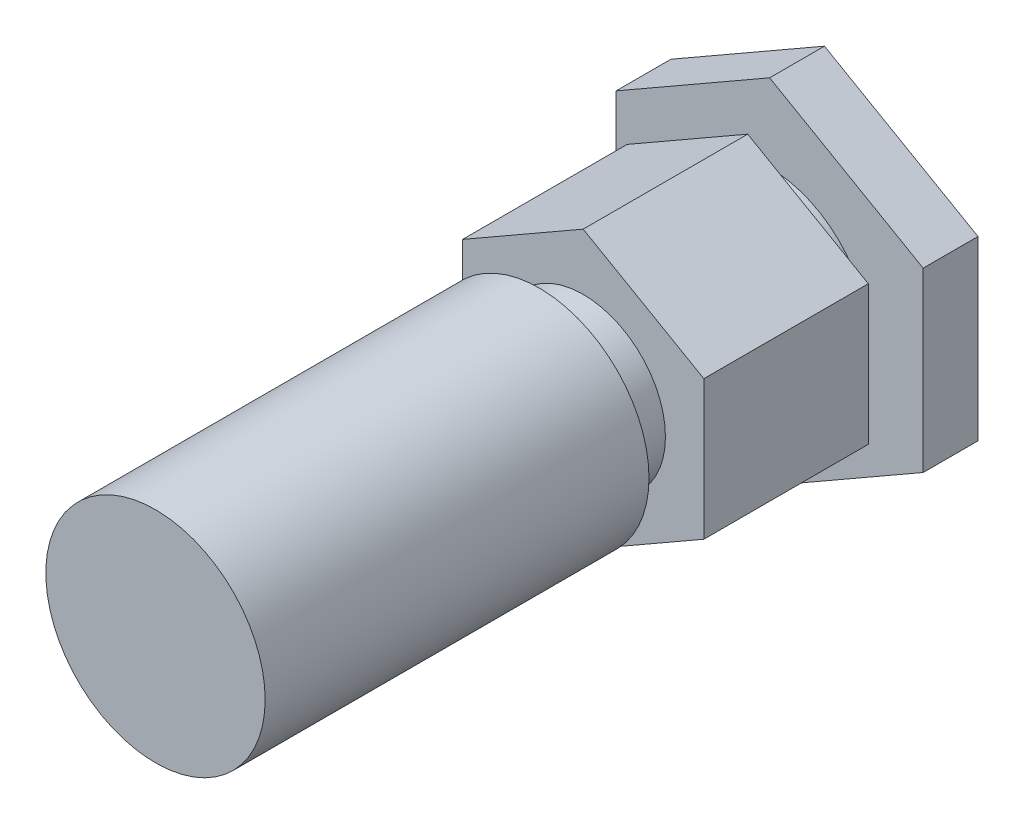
ISO-10303-21;
HEADER;
FILE_DESCRIPTION(('STEP AP214'),'2;1');
FILE_NAME('part.step','',(''),(''),'','','');
FILE_SCHEMA(('AUTOMOTIVE_DESIGN { 1 0 10303 214 1 1 1 1 }'));
ENDSEC;
DATA;
#1=APPLICATION_CONTEXT('core data for automotive mechanical design processes');
#2=APPLICATION_PROTOCOL_DEFINITION('international standard','automotive_design',2000,#1);
#3=PRODUCT_CONTEXT('',#1,'mechanical');
#4=PRODUCT('Part','Part','',(#3));
#5=PRODUCT_RELATED_PRODUCT_CATEGORY('part','',(#4));
#6=PRODUCT_DEFINITION_FORMATION('','',#4);
#7=PRODUCT_DEFINITION_CONTEXT('part definition',#1,'design');
#8=PRODUCT_DEFINITION('design','',#6,#7);
#9=PRODUCT_DEFINITION_SHAPE('','',#8);
#10=(LENGTH_UNIT() NAMED_UNIT(*) SI_UNIT(.MILLI.,.METRE.));
#11=(NAMED_UNIT(*) PLANE_ANGLE_UNIT() SI_UNIT($,.RADIAN.));
#12=(NAMED_UNIT(*) SI_UNIT($,.STERADIAN.) SOLID_ANGLE_UNIT());
#13=UNCERTAINTY_MEASURE_WITH_UNIT(LENGTH_MEASURE(1.E-05),#10,'distance_accuracy_value','');
#14=(GEOMETRIC_REPRESENTATION_CONTEXT(3) GLOBAL_UNCERTAINTY_ASSIGNED_CONTEXT((#13)) GLOBAL_UNIT_ASSIGNED_CONTEXT((#10,
#11,#12)) REPRESENTATION_CONTEXT('',''));
#15=CARTESIAN_POINT('',(0.,0.,0.));
#16=DIRECTION('',(0.,0.,1.));
#17=DIRECTION('',(1.,0.,0.));
#18=AXIS2_PLACEMENT_3D('',#15,#16,#17);
#19=CARTESIAN_POINT('',(-11.,6.34053203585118,22.));
#20=DIRECTION('',(0.,0.,1.));
#21=DIRECTION('',(1.,0.,0.));
#22=AXIS2_PLACEMENT_3D('',#19,#20,#21);
#23=PLANE('',#22);
#24=DIRECTION('',(-0.867435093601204,-0.497550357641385,0.));
#25=VECTOR('',#24,1.);
#26=CARTESIAN_POINT('',(0.,12.65,22.));
#27=LINE('',#26,#25);
#28=CARTESIAN_POINT('',(0.,12.65,22.));
#29=VERTEX_POINT('',#28);
#30=CARTESIAN_POINT('',(-11.,6.34053203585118,22.));
#31=VERTEX_POINT('',#30);
#32=EDGE_CURVE('E168',#29,#31,#27,.T.);
#33=ORIENTED_EDGE('',*,*,#32,.T.);
#34=DIRECTION('',(0.,-1.,0.));
#35=VECTOR('',#34,1.);
#36=CARTESIAN_POINT('',(-11.,6.34053203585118,22.));
#37=LINE('',#36,#35);
#38=CARTESIAN_POINT('',(-11.,-6.34053203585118,22.));
#39=VERTEX_POINT('',#38);
#40=EDGE_CURVE('E143',#31,#39,#37,.T.);
#41=ORIENTED_EDGE('',*,*,#40,.T.);
#42=DIRECTION('',(0.867435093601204,-0.497550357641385,0.));
#43=VECTOR('',#42,1.);
#44=CARTESIAN_POINT('',(0.,-12.65,22.));
#45=LINE('',#44,#43);
#46=CARTESIAN_POINT('',(0.,-12.65,22.));
#47=VERTEX_POINT('',#46);
#48=EDGE_CURVE('E171',#39,#47,#45,.T.);
#49=ORIENTED_EDGE('',*,*,#48,.T.);
#50=DIRECTION('',(0.867435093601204,0.497550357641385,0.));
#51=VECTOR('',#50,1.);
#52=CARTESIAN_POINT('',(0.,-12.65,22.));
#53=LINE('',#52,#51);
#54=CARTESIAN_POINT('',(11.,-6.34053203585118,22.));
#55=VERTEX_POINT('',#54);
#56=EDGE_CURVE('E173',#47,#55,#53,.T.);
#57=ORIENTED_EDGE('',*,*,#56,.T.);
#58=DIRECTION('',(0.,1.,0.));
#59=VECTOR('',#58,1.);
#60=CARTESIAN_POINT('',(11.,6.34053203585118,22.));
#61=LINE('',#60,#59);
#62=CARTESIAN_POINT('',(11.,6.34053203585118,22.));
#63=VERTEX_POINT('',#62);
#64=EDGE_CURVE('E175',#55,#63,#61,.T.);
#65=ORIENTED_EDGE('',*,*,#64,.T.);
#66=DIRECTION('',(-0.867435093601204,0.497550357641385,0.));
#67=VECTOR('',#66,1.);
#68=CARTESIAN_POINT('',(0.,12.65,22.));
#69=LINE('',#68,#67);
#70=EDGE_CURVE('E177',#63,#29,#69,.T.);
#71=ORIENTED_EDGE('',*,*,#70,.T.);
#72=EDGE_LOOP('',(#33,#41,#49,#57,#65,#71));
#73=FACE_BOUND('',#72,.T.);
#74=CARTESIAN_POINT('',(0.,0.,22.));
#75=DIRECTION('',(0.,0.,1.));
#76=DIRECTION('',(1.,0.,0.));
#77=AXIS2_PLACEMENT_3D('',#74,#75,#76);
#78=CIRCLE('',#77,7.5);
#79=CARTESIAN_POINT('',(7.5,0.,22.));
#80=VERTEX_POINT('',#79);
#81=EDGE_CURVE('E157',#80,#80,#78,.T.);
#82=ORIENTED_EDGE('',*,*,#81,.F.);
#83=EDGE_LOOP('',(#82));
#84=FACE_BOUND('',#83,.T.);
#85=ADVANCED_FACE('F37',(#73,#84),#23,.T.);
#86=CARTESIAN_POINT('',(-14.,8.06976804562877,5.));
#87=DIRECTION('',(0.,0.,1.));
#88=DIRECTION('',(1.,0.,0.));
#89=AXIS2_PLACEMENT_3D('',#86,#87,#88);
#90=PLANE('',#89);
#91=DIRECTION('',(-0.867435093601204,-0.497550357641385,0.));
#92=VECTOR('',#91,1.);
#93=CARTESIAN_POINT('',(0.,16.1,5.));
#94=LINE('',#93,#92);
#95=CARTESIAN_POINT('',(0.,16.1,5.));
#96=VERTEX_POINT('',#95);
#97=CARTESIAN_POINT('',(-14.,8.06976804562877,5.));
#98=VERTEX_POINT('',#97);
#99=EDGE_CURVE('E211',#96,#98,#94,.T.);
#100=ORIENTED_EDGE('',*,*,#99,.T.);
#101=DIRECTION('',(0.,-1.,0.));
#102=VECTOR('',#101,1.);
#103=CARTESIAN_POINT('',(-14.,8.06976804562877,5.));
#104=LINE('',#103,#102);
#105=CARTESIAN_POINT('',(-14.,-8.06976804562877,5.));
#106=VERTEX_POINT('',#105);
#107=EDGE_CURVE('E213',#98,#106,#104,.T.);
#108=ORIENTED_EDGE('',*,*,#107,.T.);
#109=DIRECTION('',(0.867435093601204,-0.497550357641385,0.));
#110=VECTOR('',#109,1.);
#111=CARTESIAN_POINT('',(0.,-16.1,5.));
#112=LINE('',#111,#110);
#113=CARTESIAN_POINT('',(0.,-16.1,5.));
#114=VERTEX_POINT('',#113);
#115=EDGE_CURVE('E215',#106,#114,#112,.T.);
#116=ORIENTED_EDGE('',*,*,#115,.T.);
#117=DIRECTION('',(0.867435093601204,0.497550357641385,0.));
#118=VECTOR('',#117,1.);
#119=CARTESIAN_POINT('',(0.,-16.1,5.));
#120=LINE('',#119,#118);
#121=CARTESIAN_POINT('',(14.,-8.06976804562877,5.));
#122=VERTEX_POINT('',#121);
#123=EDGE_CURVE('E217',#114,#122,#120,.T.);
#124=ORIENTED_EDGE('',*,*,#123,.T.);
#125=DIRECTION('',(0.,1.,0.));
#126=VECTOR('',#125,1.);
#127=CARTESIAN_POINT('',(14.,8.06976804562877,5.));
#128=LINE('',#127,#126);
#129=CARTESIAN_POINT('',(14.,8.06976804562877,5.));
#130=VERTEX_POINT('',#129);
#131=EDGE_CURVE('E58',#122,#130,#128,.T.);
#132=ORIENTED_EDGE('',*,*,#131,.T.);
#133=DIRECTION('',(-0.867435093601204,0.497550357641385,0.));
#134=VECTOR('',#133,1.);
#135=CARTESIAN_POINT('',(0.,16.1,5.));
#136=LINE('',#135,#134);
#137=EDGE_CURVE('E53',#130,#96,#136,.T.);
#138=ORIENTED_EDGE('',*,*,#137,.T.);
#139=EDGE_LOOP('',(#100,#108,#116,#124,#132,#138));
#140=FACE_BOUND('',#139,.T.);
#141=CARTESIAN_POINT('',(0.,0.,5.));
#142=DIRECTION('',(0.,0.,1.));
#143=DIRECTION('',(1.,0.,0.));
#144=AXIS2_PLACEMENT_3D('',#141,#142,#143);
#145=CIRCLE('',#144,9.);
#146=CARTESIAN_POINT('',(9.,0.,5.));
#147=VERTEX_POINT('',#146);
#148=EDGE_CURVE('E195',#147,#147,#145,.F.);
#149=ORIENTED_EDGE('',*,*,#148,.T.);
#150=EDGE_LOOP('',(#149));
#151=FACE_BOUND('',#150,.T.);
#152=ADVANCED_FACE('F245',(#140,#151),#90,.T.);
#153=CARTESIAN_POINT('',(-14.,8.06976804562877,0.));
#154=DIRECTION('',(0.,0.,1.));
#155=DIRECTION('',(1.,0.,0.));
#156=AXIS2_PLACEMENT_3D('',#153,#154,#155);
#157=PLANE('',#156);
#158=DIRECTION('',(-0.867435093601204,-0.497550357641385,0.));
#159=VECTOR('',#158,1.);
#160=CARTESIAN_POINT('',(0.,16.1,0.));
#161=LINE('',#160,#159);
#162=CARTESIAN_POINT('',(0.,16.1,0.));
#163=VERTEX_POINT('',#162);
#164=CARTESIAN_POINT('',(-14.,8.06976804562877,0.));
#165=VERTEX_POINT('',#164);
#166=EDGE_CURVE('E198',#163,#165,#161,.T.);
#167=ORIENTED_EDGE('',*,*,#166,.F.);
#168=DIRECTION('',(-0.867435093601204,0.497550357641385,0.));
#169=VECTOR('',#168,1.);
#170=CARTESIAN_POINT('',(0.,16.1,0.));
#171=LINE('',#170,#169);
#172=CARTESIAN_POINT('',(14.,8.06976804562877,0.));
#173=VERTEX_POINT('',#172);
#174=EDGE_CURVE('E209',#173,#163,#171,.T.);
#175=ORIENTED_EDGE('',*,*,#174,.F.);
#176=DIRECTION('',(0.,1.,0.));
#177=VECTOR('',#176,1.);
#178=CARTESIAN_POINT('',(14.,8.06976804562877,0.));
#179=LINE('',#178,#177);
#180=CARTESIAN_POINT('',(14.,-8.06976804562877,0.));
#181=VERTEX_POINT('',#180);
#182=EDGE_CURVE('E207',#181,#173,#179,.T.);
#183=ORIENTED_EDGE('',*,*,#182,.F.);
#184=DIRECTION('',(0.867435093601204,0.497550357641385,0.));
#185=VECTOR('',#184,1.);
#186=CARTESIAN_POINT('',(0.,-16.1,0.));
#187=LINE('',#186,#185);
#188=CARTESIAN_POINT('',(0.,-16.1,0.));
#189=VERTEX_POINT('',#188);
#190=EDGE_CURVE('E205',#189,#181,#187,.T.);
#191=ORIENTED_EDGE('',*,*,#190,.F.);
#192=DIRECTION('',(0.867435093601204,-0.497550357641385,0.));
#193=VECTOR('',#192,1.);
#194=CARTESIAN_POINT('',(0.,-16.1,0.));
#195=LINE('',#194,#193);
#196=CARTESIAN_POINT('',(-14.,-8.06976804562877,0.));
#197=VERTEX_POINT('',#196);
#198=EDGE_CURVE('E203',#197,#189,#195,.T.);
#199=ORIENTED_EDGE('',*,*,#198,.F.);
#200=DIRECTION('',(0.,-1.,0.));
#201=VECTOR('',#200,1.);
#202=CARTESIAN_POINT('',(-14.,8.06976804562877,0.));
#203=LINE('',#202,#201);
#204=EDGE_CURVE('E201',#165,#197,#203,.T.);
#205=ORIENTED_EDGE('',*,*,#204,.F.);
#206=EDGE_LOOP('',(#167,#175,#183,#191,#199,#205));
#207=FACE_BOUND('',#206,.T.);
#208=CARTESIAN_POINT('',(0.,0.,0.));
#209=DIRECTION('',(0.,0.,1.));
#210=DIRECTION('',(1.,0.,0.));
#211=AXIS2_PLACEMENT_3D('',#208,#209,#210);
#212=CIRCLE('',#211,9.);
#213=CARTESIAN_POINT('',(9.,0.,0.));
#214=VERTEX_POINT('',#213);
#215=EDGE_CURVE('E46',#214,#214,#212,.F.);
#216=ORIENTED_EDGE('',*,*,#215,.F.);
#217=EDGE_LOOP('',(#216));
#218=FACE_BOUND('',#217,.T.);
#219=ADVANCED_FACE('F243',(#207,#218),#157,.F.);
#220=CARTESIAN_POINT('',(0.,16.1,5.));
#221=DIRECTION('',(0.497550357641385,-0.867435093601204,0.));
#222=DIRECTION('',(0.867435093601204,0.497550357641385,0.));
#223=AXIS2_PLACEMENT_3D('',#220,#221,#222);
#224=PLANE('',#223);
#225=ORIENTED_EDGE('',*,*,#166,.T.);
#226=DIRECTION('',(0.,0.,-1.));
#227=VECTOR('',#226,1.);
#228=CARTESIAN_POINT('',(-14.,8.06976804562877,5.));
#229=LINE('',#228,#227);
#230=EDGE_CURVE('E236',#98,#165,#229,.T.);
#231=ORIENTED_EDGE('',*,*,#230,.F.);
#232=ORIENTED_EDGE('',*,*,#99,.F.);
#233=DIRECTION('',(0.,0.,-1.));
#234=VECTOR('',#233,1.);
#235=CARTESIAN_POINT('',(0.,16.1,5.));
#236=LINE('',#235,#234);
#237=EDGE_CURVE('E221',#96,#163,#236,.T.);
#238=ORIENTED_EDGE('',*,*,#237,.T.);
#239=EDGE_LOOP('',(#225,#231,#232,#238));
#240=FACE_BOUND('',#239,.T.);
#241=ADVANCED_FACE('F39',(#240),#224,.F.);
#242=CARTESIAN_POINT('',(-14.,8.06976804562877,5.));
#243=DIRECTION('',(1.,0.,0.));
#244=DIRECTION('',(0.,0.,-1.));
#245=AXIS2_PLACEMENT_3D('',#242,#243,#244);
#246=PLANE('',#245);
#247=ORIENTED_EDGE('',*,*,#204,.T.);
#248=DIRECTION('',(0.,0.,-1.));
#249=VECTOR('',#248,1.);
#250=CARTESIAN_POINT('',(-14.,-8.06976804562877,5.));
#251=LINE('',#250,#249);
#252=EDGE_CURVE('E233',#106,#197,#251,.T.);
#253=ORIENTED_EDGE('',*,*,#252,.F.);
#254=ORIENTED_EDGE('',*,*,#107,.F.);
#255=ORIENTED_EDGE('',*,*,#230,.T.);
#256=EDGE_LOOP('',(#247,#253,#254,#255));
#257=FACE_BOUND('',#256,.T.);
#258=ADVANCED_FACE('F252',(#257),#246,.F.);
#259=CARTESIAN_POINT('',(0.,-16.1,5.));
#260=DIRECTION('',(0.497550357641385,0.867435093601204,0.));
#261=DIRECTION('',(-0.867435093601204,0.497550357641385,0.));
#262=AXIS2_PLACEMENT_3D('',#259,#260,#261);
#263=PLANE('',#262);
#264=ORIENTED_EDGE('',*,*,#198,.T.);
#265=DIRECTION('',(0.,0.,-1.));
#266=VECTOR('',#265,1.);
#267=CARTESIAN_POINT('',(0.,-16.1,5.));
#268=LINE('',#267,#266);
#269=EDGE_CURVE('E230',#114,#189,#268,.T.);
#270=ORIENTED_EDGE('',*,*,#269,.F.);
#271=ORIENTED_EDGE('',*,*,#115,.F.);
#272=ORIENTED_EDGE('',*,*,#252,.T.);
#273=EDGE_LOOP('',(#264,#270,#271,#272));
#274=FACE_BOUND('',#273,.T.);
#275=ADVANCED_FACE('F468',(#274),#263,.F.);
#276=CARTESIAN_POINT('',(0.,-16.1,5.));
#277=DIRECTION('',(-0.497550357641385,0.867435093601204,0.));
#278=DIRECTION('',(-0.867435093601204,-0.497550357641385,0.));
#279=AXIS2_PLACEMENT_3D('',#276,#277,#278);
#280=PLANE('',#279);
#281=ORIENTED_EDGE('',*,*,#190,.T.);
#282=DIRECTION('',(0.,0.,-1.));
#283=VECTOR('',#282,1.);
#284=CARTESIAN_POINT('',(14.,-8.06976804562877,5.));
#285=LINE('',#284,#283);
#286=EDGE_CURVE('E227',#122,#181,#285,.T.);
#287=ORIENTED_EDGE('',*,*,#286,.F.);
#288=ORIENTED_EDGE('',*,*,#123,.F.);
#289=ORIENTED_EDGE('',*,*,#269,.T.);
#290=EDGE_LOOP('',(#281,#287,#288,#289));
#291=FACE_BOUND('',#290,.T.);
#292=ADVANCED_FACE('F459',(#291),#280,.F.);
#293=CARTESIAN_POINT('',(14.,8.06976804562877,5.));
#294=DIRECTION('',(-1.,0.,0.));
#295=DIRECTION('',(0.,0.,1.));
#296=AXIS2_PLACEMENT_3D('',#293,#294,#295);
#297=PLANE('',#296);
#298=ORIENTED_EDGE('',*,*,#182,.T.);
#299=DIRECTION('',(0.,0.,-1.));
#300=VECTOR('',#299,1.);
#301=CARTESIAN_POINT('',(14.,8.06976804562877,5.));
#302=LINE('',#301,#300);
#303=EDGE_CURVE('E224',#130,#173,#302,.T.);
#304=ORIENTED_EDGE('',*,*,#303,.F.);
#305=ORIENTED_EDGE('',*,*,#131,.F.);
#306=ORIENTED_EDGE('',*,*,#286,.T.);
#307=EDGE_LOOP('',(#298,#304,#305,#306));
#308=FACE_BOUND('',#307,.T.);
#309=ADVANCED_FACE('F450',(#308),#297,.F.);
#310=CARTESIAN_POINT('',(0.,16.1,5.));
#311=DIRECTION('',(-0.497550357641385,-0.867435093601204,0.));
#312=DIRECTION('',(0.867435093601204,-0.497550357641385,0.));
#313=AXIS2_PLACEMENT_3D('',#310,#311,#312);
#314=PLANE('',#313);
#315=ORIENTED_EDGE('',*,*,#174,.T.);
#316=ORIENTED_EDGE('',*,*,#237,.F.);
#317=ORIENTED_EDGE('',*,*,#137,.F.);
#318=ORIENTED_EDGE('',*,*,#303,.T.);
#319=EDGE_LOOP('',(#315,#316,#317,#318));
#320=FACE_BOUND('',#319,.T.);
#321=ADVANCED_FACE('F311',(#320),#314,.F.);
#322=CARTESIAN_POINT('',(0.,0.,-2.));
#323=DIRECTION('',(0.,0.,1.));
#324=DIRECTION('',(1.,0.,0.));
#325=AXIS2_PLACEMENT_3D('',#322,#323,#324);
#326=PLANE('',#325);
#327=CARTESIAN_POINT('',(0.,0.,-2.));
#328=DIRECTION('',(0.,0.,1.));
#329=DIRECTION('',(1.,0.,0.));
#330=AXIS2_PLACEMENT_3D('',#327,#328,#329);
#331=CIRCLE('',#330,9.);
#332=CARTESIAN_POINT('',(9.,0.,-2.));
#333=VERTEX_POINT('',#332);
#334=EDGE_CURVE('E147',#333,#333,#331,.T.);
#335=ORIENTED_EDGE('',*,*,#334,.F.);
#336=EDGE_LOOP('',(#335));
#337=FACE_BOUND('',#336,.T.);
#338=ADVANCED_FACE('F305',(#337),#326,.F.);
#339=CARTESIAN_POINT('',(0.,0.,7.));
#340=DIRECTION('',(0.,0.,-1.));
#341=DIRECTION('',(-1.,0.,0.));
#342=AXIS2_PLACEMENT_3D('',#339,#340,#341);
#343=CYLINDRICAL_SURFACE('',#342,9.);
#344=ORIENTED_EDGE('',*,*,#334,.T.);
#345=EDGE_LOOP('',(#344));
#346=FACE_BOUND('',#345,.T.);
#347=ORIENTED_EDGE('',*,*,#215,.T.);
#348=EDGE_LOOP('',(#347));
#349=FACE_BOUND('',#348,.T.);
#350=ADVANCED_FACE('F241',(#346,#349),#343,.T.);
#351=ORIENTED_EDGE('',*,*,#148,.F.);
#352=EDGE_LOOP('',(#351));
#353=FACE_BOUND('',#352,.T.);
#354=CARTESIAN_POINT('',(0.,0.,7.));
#355=DIRECTION('',(0.,0.,1.));
#356=DIRECTION('',(1.,0.,0.));
#357=AXIS2_PLACEMENT_3D('',#354,#355,#356);
#358=CIRCLE('',#357,9.);
#359=CARTESIAN_POINT('',(9.,0.,7.));
#360=VERTEX_POINT('',#359);
#361=EDGE_CURVE('E192',#360,#360,#358,.T.);
#362=ORIENTED_EDGE('',*,*,#361,.F.);
#363=EDGE_LOOP('',(#362));
#364=FACE_BOUND('',#363,.T.);
#365=ADVANCED_FACE('F295',(#353,#364),#343,.T.);
#366=CARTESIAN_POINT('',(-11.,6.34053203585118,7.));
#367=DIRECTION('',(0.,0.,1.));
#368=DIRECTION('',(1.,0.,0.));
#369=AXIS2_PLACEMENT_3D('',#366,#367,#368);
#370=PLANE('',#369);
#371=DIRECTION('',(-0.867435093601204,-0.497550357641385,0.));
#372=VECTOR('',#371,1.);
#373=CARTESIAN_POINT('',(0.,12.65,7.));
#374=LINE('',#373,#372);
#375=CARTESIAN_POINT('',(0.,12.65,7.));
#376=VERTEX_POINT('',#375);
#377=CARTESIAN_POINT('',(-11.,6.34053203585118,7.));
#378=VERTEX_POINT('',#377);
#379=EDGE_CURVE('E133',#376,#378,#374,.T.);
#380=ORIENTED_EDGE('',*,*,#379,.F.);
#381=DIRECTION('',(-0.867435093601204,0.497550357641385,0.));
#382=VECTOR('',#381,1.);
#383=CARTESIAN_POINT('',(0.,12.65,7.));
#384=LINE('',#383,#382);
#385=CARTESIAN_POINT('',(11.,6.34053203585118,7.));
#386=VERTEX_POINT('',#385);
#387=EDGE_CURVE('E166',#386,#376,#384,.T.);
#388=ORIENTED_EDGE('',*,*,#387,.F.);
#389=DIRECTION('',(0.,1.,0.));
#390=VECTOR('',#389,1.);
#391=CARTESIAN_POINT('',(11.,6.34053203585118,7.));
#392=LINE('',#391,#390);
#393=CARTESIAN_POINT('',(11.,-6.34053203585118,7.));
#394=VERTEX_POINT('',#393);
#395=EDGE_CURVE('E164',#394,#386,#392,.T.);
#396=ORIENTED_EDGE('',*,*,#395,.F.);
#397=DIRECTION('',(0.867435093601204,0.497550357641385,0.));
#398=VECTOR('',#397,1.);
#399=CARTESIAN_POINT('',(0.,-12.65,7.));
#400=LINE('',#399,#398);
#401=CARTESIAN_POINT('',(0.,-12.65,7.));
#402=VERTEX_POINT('',#401);
#403=EDGE_CURVE('E162',#402,#394,#400,.T.);
#404=ORIENTED_EDGE('',*,*,#403,.F.);
#405=DIRECTION('',(0.867435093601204,-0.497550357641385,0.));
#406=VECTOR('',#405,1.);
#407=CARTESIAN_POINT('',(0.,-12.65,7.));
#408=LINE('',#407,#406);
#409=CARTESIAN_POINT('',(-11.,-6.34053203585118,7.));
#410=VERTEX_POINT('',#409);
#411=EDGE_CURVE('E135',#410,#402,#408,.T.);
#412=ORIENTED_EDGE('',*,*,#411,.F.);
#413=DIRECTION('',(0.,-1.,0.));
#414=VECTOR('',#413,1.);
#415=CARTESIAN_POINT('',(-11.,6.34053203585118,7.));
#416=LINE('',#415,#414);
#417=EDGE_CURVE('E127',#378,#410,#416,.T.);
#418=ORIENTED_EDGE('',*,*,#417,.F.);
#419=EDGE_LOOP('',(#380,#388,#396,#404,#412,#418));
#420=FACE_BOUND('',#419,.T.);
#421=ORIENTED_EDGE('',*,*,#361,.T.);
#422=EDGE_LOOP('',(#421));
#423=FACE_BOUND('',#422,.T.);
#424=ADVANCED_FACE('F129',(#420,#423),#370,.F.);
#425=CARTESIAN_POINT('',(0.,12.65,22.));
#426=DIRECTION('',(0.497550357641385,-0.867435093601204,0.));
#427=DIRECTION('',(0.867435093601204,0.497550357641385,0.));
#428=AXIS2_PLACEMENT_3D('',#425,#426,#427);
#429=PLANE('',#428);
#430=ORIENTED_EDGE('',*,*,#379,.T.);
#431=DIRECTION('',(0.,0.,-1.));
#432=VECTOR('',#431,1.);
#433=CARTESIAN_POINT('',(-11.,6.34053203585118,22.));
#434=LINE('',#433,#432);
#435=EDGE_CURVE('E141',#31,#378,#434,.T.);
#436=ORIENTED_EDGE('',*,*,#435,.F.);
#437=ORIENTED_EDGE('',*,*,#32,.F.);
#438=DIRECTION('',(0.,0.,-1.));
#439=VECTOR('',#438,1.);
#440=CARTESIAN_POINT('',(0.,12.65,22.));
#441=LINE('',#440,#439);
#442=EDGE_CURVE('E153',#29,#376,#441,.T.);
#443=ORIENTED_EDGE('',*,*,#442,.T.);
#444=EDGE_LOOP('',(#430,#436,#437,#443));
#445=FACE_BOUND('',#444,.T.);
#446=ADVANCED_FACE('F151',(#445),#429,.F.);
#447=CARTESIAN_POINT('',(-11.,6.34053203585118,22.));
#448=DIRECTION('',(1.,0.,0.));
#449=DIRECTION('',(0.,0.,-1.));
#450=AXIS2_PLACEMENT_3D('',#447,#448,#449);
#451=PLANE('',#450);
#452=ORIENTED_EDGE('',*,*,#417,.T.);
#453=DIRECTION('',(0.,0.,-1.));
#454=VECTOR('',#453,1.);
#455=CARTESIAN_POINT('',(-11.,-6.34053203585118,22.));
#456=LINE('',#455,#454);
#457=EDGE_CURVE('E148',#39,#410,#456,.T.);
#458=ORIENTED_EDGE('',*,*,#457,.F.);
#459=ORIENTED_EDGE('',*,*,#40,.F.);
#460=ORIENTED_EDGE('',*,*,#435,.T.);
#461=EDGE_LOOP('',(#452,#458,#459,#460));
#462=FACE_BOUND('',#461,.T.);
#463=ADVANCED_FACE('F142',(#462),#451,.F.);
#464=CARTESIAN_POINT('',(0.,-12.65,22.));
#465=DIRECTION('',(0.497550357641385,0.867435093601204,0.));
#466=DIRECTION('',(-0.867435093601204,0.497550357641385,0.));
#467=AXIS2_PLACEMENT_3D('',#464,#465,#466);
#468=PLANE('',#467);
#469=ORIENTED_EDGE('',*,*,#411,.T.);
#470=DIRECTION('',(0.,0.,-1.));
#471=VECTOR('',#470,1.);
#472=CARTESIAN_POINT('',(0.,-12.65,22.));
#473=LINE('',#472,#471);
#474=EDGE_CURVE('E186',#47,#402,#473,.T.);
#475=ORIENTED_EDGE('',*,*,#474,.F.);
#476=ORIENTED_EDGE('',*,*,#48,.F.);
#477=ORIENTED_EDGE('',*,*,#457,.T.);
#478=EDGE_LOOP('',(#469,#475,#476,#477));
#479=FACE_BOUND('',#478,.T.);
#480=ADVANCED_FACE('F316',(#479),#468,.F.);
#481=CARTESIAN_POINT('',(0.,-12.65,22.));
#482=DIRECTION('',(-0.497550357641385,0.867435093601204,0.));
#483=DIRECTION('',(-0.867435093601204,-0.497550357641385,0.));
#484=AXIS2_PLACEMENT_3D('',#481,#482,#483);
#485=PLANE('',#484);
#486=ORIENTED_EDGE('',*,*,#403,.T.);
#487=DIRECTION('',(0.,0.,-1.));
#488=VECTOR('',#487,1.);
#489=CARTESIAN_POINT('',(11.,-6.34053203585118,22.));
#490=LINE('',#489,#488);
#491=EDGE_CURVE('E183',#55,#394,#490,.T.);
#492=ORIENTED_EDGE('',*,*,#491,.F.);
#493=ORIENTED_EDGE('',*,*,#56,.F.);
#494=ORIENTED_EDGE('',*,*,#474,.T.);
#495=EDGE_LOOP('',(#486,#492,#493,#494));
#496=FACE_BOUND('',#495,.T.);
#497=ADVANCED_FACE('F319',(#496),#485,.F.);
#498=CARTESIAN_POINT('',(11.,6.34053203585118,22.));
#499=DIRECTION('',(-1.,0.,0.));
#500=DIRECTION('',(0.,0.,1.));
#501=AXIS2_PLACEMENT_3D('',#498,#499,#500);
#502=PLANE('',#501);
#503=ORIENTED_EDGE('',*,*,#395,.T.);
#504=DIRECTION('',(0.,0.,-1.));
#505=VECTOR('',#504,1.);
#506=CARTESIAN_POINT('',(11.,6.34053203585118,22.));
#507=LINE('',#506,#505);
#508=EDGE_CURVE('E180',#63,#386,#507,.T.);
#509=ORIENTED_EDGE('',*,*,#508,.F.);
#510=ORIENTED_EDGE('',*,*,#64,.F.);
#511=ORIENTED_EDGE('',*,*,#491,.T.);
#512=EDGE_LOOP('',(#503,#509,#510,#511));
#513=FACE_BOUND('',#512,.T.);
#514=ADVANCED_FACE('F323',(#513),#502,.F.);
#515=CARTESIAN_POINT('',(0.,12.65,22.));
#516=DIRECTION('',(-0.497550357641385,-0.867435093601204,0.));
#517=DIRECTION('',(0.867435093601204,-0.497550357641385,0.));
#518=AXIS2_PLACEMENT_3D('',#515,#516,#517);
#519=PLANE('',#518);
#520=ORIENTED_EDGE('',*,*,#387,.T.);
#521=ORIENTED_EDGE('',*,*,#442,.F.);
#522=ORIENTED_EDGE('',*,*,#70,.F.);
#523=ORIENTED_EDGE('',*,*,#508,.T.);
#524=EDGE_LOOP('',(#520,#521,#522,#523));
#525=FACE_BOUND('',#524,.T.);
#526=ADVANCED_FACE('F292',(#525),#519,.F.);
#527=CARTESIAN_POINT('',(0.,0.,26.));
#528=DIRECTION('',(0.,0.,-1.));
#529=DIRECTION('',(-1.,0.,0.));
#530=AXIS2_PLACEMENT_3D('',#527,#528,#529);
#531=CYLINDRICAL_SURFACE('',#530,7.5);
#532=CARTESIAN_POINT('',(0.,0.,26.));
#533=DIRECTION('',(0.,0.,1.));
#534=DIRECTION('',(1.,0.,0.));
#535=AXIS2_PLACEMENT_3D('',#532,#533,#534);
#536=CIRCLE('',#535,7.5);
#537=CARTESIAN_POINT('',(7.5,0.,26.));
#538=VERTEX_POINT('',#537);
#539=EDGE_CURVE('E154',#538,#538,#536,.T.);
#540=ORIENTED_EDGE('',*,*,#539,.F.);
#541=EDGE_LOOP('',(#540));
#542=FACE_BOUND('',#541,.T.);
#543=ORIENTED_EDGE('',*,*,#81,.T.);
#544=EDGE_LOOP('',(#543));
#545=FACE_BOUND('',#544,.T.);
#546=ADVANCED_FACE('F290',(#542,#545),#531,.T.);
#547=CARTESIAN_POINT('',(0.,0.,26.));
#548=DIRECTION('',(0.,0.,1.));
#549=DIRECTION('',(1.,0.,0.));
#550=AXIS2_PLACEMENT_3D('',#547,#548,#549);
#551=PLANE('',#550);
#552=CARTESIAN_POINT('',(0.,0.,26.));
#553=DIRECTION('',(0.,0.,1.));
#554=DIRECTION('',(1.,0.,0.));
#555=AXIS2_PLACEMENT_3D('',#552,#553,#554);
#556=CIRCLE('',#555,10.);
#557=CARTESIAN_POINT('',(10.,0.,26.));
#558=VERTEX_POINT('',#557);
#559=EDGE_CURVE('E520',#558,#558,#556,.T.);
#560=ORIENTED_EDGE('',*,*,#559,.F.);
#561=EDGE_LOOP('',(#560));
#562=FACE_BOUND('',#561,.T.);
#563=ORIENTED_EDGE('',*,*,#539,.T.);
#564=EDGE_LOOP('',(#563));
#565=FACE_BOUND('',#564,.T.);
#566=ADVANCED_FACE('F284',(#562,#565),#551,.F.);
#567=CARTESIAN_POINT('',(0.,0.,61.));
#568=DIRECTION('',(0.,0.,-1.));
#569=DIRECTION('',(-1.,0.,0.));
#570=AXIS2_PLACEMENT_3D('',#567,#568,#569);
#571=CYLINDRICAL_SURFACE('',#570,10.);
#572=CARTESIAN_POINT('',(0.,0.,61.));
#573=DIRECTION('',(0.,0.,1.));
#574=DIRECTION('',(1.,0.,0.));
#575=AXIS2_PLACEMENT_3D('',#572,#573,#574);
#576=CIRCLE('',#575,10.);
#577=CARTESIAN_POINT('',(10.,0.,61.));
#578=VERTEX_POINT('',#577);
#579=EDGE_CURVE('E518',#578,#578,#576,.T.);
#580=ORIENTED_EDGE('',*,*,#579,.F.);
#581=EDGE_LOOP('',(#580));
#582=FACE_BOUND('',#581,.T.);
#583=ORIENTED_EDGE('',*,*,#559,.T.);
#584=EDGE_LOOP('',(#583));
#585=FACE_BOUND('',#584,.T.);
#586=ADVANCED_FACE('F288',(#582,#585),#571,.T.);
#587=CARTESIAN_POINT('',(0.,0.,61.));
#588=DIRECTION('',(0.,0.,1.));
#589=DIRECTION('',(1.,0.,0.));
#590=AXIS2_PLACEMENT_3D('',#587,#588,#589);
#591=PLANE('',#590);
#592=ORIENTED_EDGE('',*,*,#579,.T.);
#593=EDGE_LOOP('',(#592));
#594=FACE_BOUND('',#593,.T.);
#595=ADVANCED_FACE('F356',(#594),#591,.T.);
#596=CLOSED_SHELL('',(#85,#152,#219,#241,#258,#275,#292,#309,#321,#338,#350,#365,#424,#446,#463,
#480,#497,#514,#526,#546,#566,#586,#595));
#597=CARTESIAN_POINT('',(0.,0.,22.));
#598=DIRECTION('',(0.,0.,1.));
#599=DIRECTION('',(1.,0.,0.));
#600=AXIS2_PLACEMENT_3D('',#597,#598,#599);
#601=CIRCLE('',#600,6.5);
#602=CARTESIAN_POINT('',(6.5,0.,22.));
#603=VERTEX_POINT('',#602);
#604=EDGE_CURVE('E12',#603,#603,#601,.F.);
#605=ORIENTED_EDGE('',*,*,#604,.F.);
#606=EDGE_LOOP('',(#605));
#607=FACE_BOUND('',#606,.T.);
#608=ADVANCED_FACE('F260',(#607),#23,.T.);
#609=CARTESIAN_POINT('',(0.,0.,26.));
#610=DIRECTION('',(0.,0.,-1.));
#611=DIRECTION('',(-1.,0.,0.));
#612=AXIS2_PLACEMENT_3D('',#609,#610,#611);
#613=CYLINDRICAL_SURFACE('',#612,6.5);
#614=CARTESIAN_POINT('',(0.,0.,26.));
#615=DIRECTION('',(0.,0.,1.));
#616=DIRECTION('',(1.,0.,0.));
#617=AXIS2_PLACEMENT_3D('',#614,#615,#616);
#618=CIRCLE('',#617,6.5);
#619=CARTESIAN_POINT('',(6.5,0.,26.));
#620=VERTEX_POINT('',#619);
#621=EDGE_CURVE('E519',#620,#620,#618,.T.);
#622=ORIENTED_EDGE('',*,*,#621,.T.);
#623=EDGE_LOOP('',(#622));
#624=FACE_BOUND('',#623,.T.);
#625=ORIENTED_EDGE('',*,*,#604,.T.);
#626=EDGE_LOOP('',(#625));
#627=FACE_BOUND('',#626,.T.);
#628=ADVANCED_FACE('F267',(#624,#627),#613,.F.);
#629=ORIENTED_EDGE('',*,*,#621,.F.);
#630=EDGE_LOOP('',(#629));
#631=FACE_BOUND('',#630,.T.);
#632=ADVANCED_FACE('F274',(#631),#551,.F.);
#633=CLOSED_SHELL('',(#608,#628,#632));
#634=ORIENTED_CLOSED_SHELL('',*,#633,.T.);
#635=BREP_WITH_VOIDS('B2',#596,(#634));
#636=ADVANCED_BREP_SHAPE_REPRESENTATION('',(#18,#635),#14);
#637=SHAPE_DEFINITION_REPRESENTATION(#9,#636);
ENDSEC;
END-ISO-10303-21;
